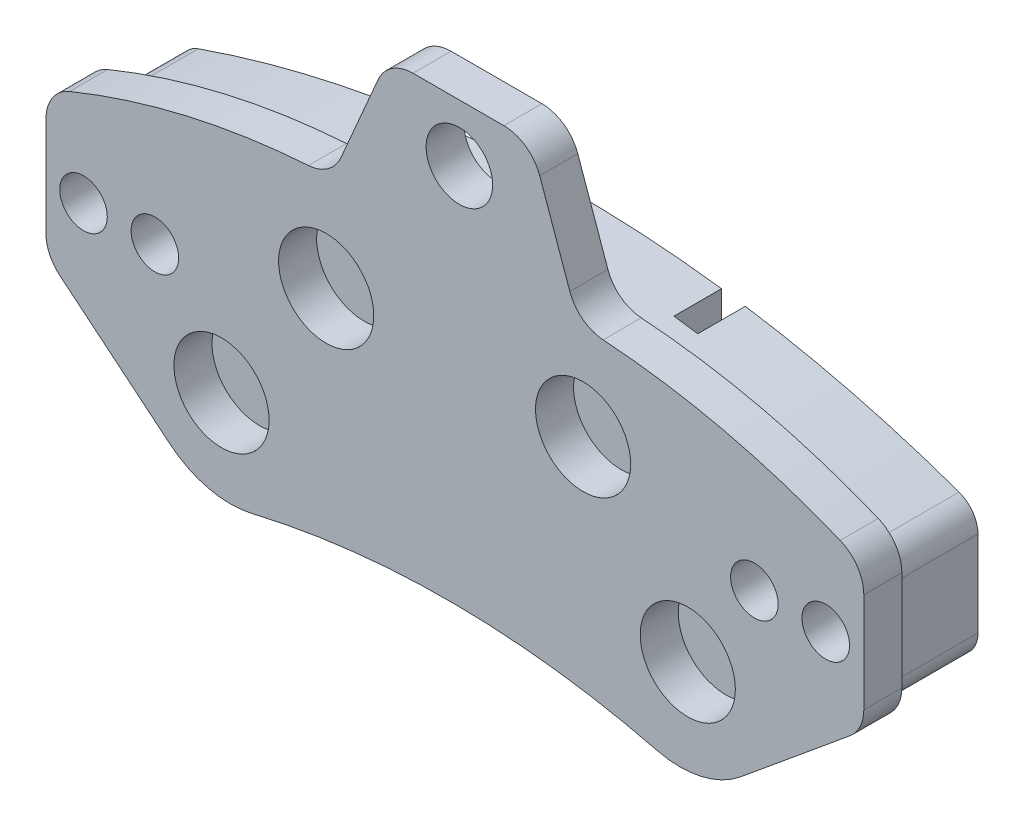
from build123d import *

# Parameters (mm, degrees)
ESQUISSE1_R             = 3.5
ESQUISSE1_R_2           = 2.5
ESQUISSE1_R_3           = 5
EXTRUSION1_DEPTH        = 4
EXTRUSION2_DEPTH        = 9
ENL_V_START             = -5
ENL_V_MAT_EXTRU_1_DEPTH = 5


with BuildPart() as part:
    # Esquisse1 → Extrusion1 (new body)
    with BuildSketch(Plane.XY):
        with BuildLine():
            Line((-4.869143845, 56), (4.671572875, 56))
            ThreePointArc((4.671572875, 56), (6.980973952, 55.265986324), (8.442809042, 53.333333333))
            Line((8.442809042, 53.333333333), (11.6082658, 44.380069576))
            ThreePointArc((11.6082658, 44.380069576), (12.96022052, 42.527955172), (15.107228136, 41.722680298))
            ThreePointArc((15.107228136, 41.722680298), (27.795699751, 39.825876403), (40.017802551, 35.925186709))
            ThreePointArc((40.017802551, 35.925186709), (41.821988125, 34.452430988), (42.5, 32.224338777))
            Line((42.5, 32.224338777), (42.5, 21.743482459))
            ThreePointArc((42.5, 21.743482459), (42.118136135, 20.037876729), (41.045454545, 18.657925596))
            Line((41.045454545, 18.657925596), (29.553799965, 9.177794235))
            ThreePointArc((29.553799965, 9.177794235), (25.394935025, 7.137764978), (20.762972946, 7.190720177))
            ThreePointArc((20.762972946, 7.190720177), (-0.484594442, 9.880043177), (-21.765977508, 7.472905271))
            ThreePointArc((-21.765977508, 7.472905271), (-26.333665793, 7.466147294), (-30.427862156, 9.491333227))
            Line((-30.427862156, 9.491333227), (-41.986580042, 19.026788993))
            ThreePointArc((-41.986580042, 19.026788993), (-43.059261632, 20.406740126), (-43.441125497, 22.112345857))
            Line((-43.441125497, 22.112345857), (-43.441125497, 32.593202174))
            ThreePointArc((-43.441125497, 32.593202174), (-42.763113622, 34.821294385), (-40.958928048, 36.294050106))
            ThreePointArc((-40.958928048, 36.294050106), (-28.64761844, 40.215447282), (-15.865606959, 42.103801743))
            ThreePointArc((-15.865606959, 42.103801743), (-13.821906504, 42.827339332), (-12.455870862, 44.510837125))
            Line((-12.455870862, 44.510837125), (-8.542016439, 53.584300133))
            ThreePointArc((-8.542016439, 53.584300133), (-7.06718837, 55.341945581), (-4.869143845, 56))
        make_face()
        with Locations((0, 50)):
            Circle(ESQUISSE1_R, mode=Mode.SUBTRACT)
        with Locations((38.5, 26.857864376)):
            Circle(ESQUISSE1_R_2, mode=Mode.SUBTRACT)
        with Locations((31, 26.857864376)):
            Circle(ESQUISSE1_R_2, mode=Mode.SUBTRACT)
        with Locations((-32, 26.857864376)):
            Circle(ESQUISSE1_R_2, mode=Mode.SUBTRACT)
        with Locations((-39.5, 26.857864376)):
            Circle(ESQUISSE1_R_2, mode=Mode.SUBTRACT)
        with Locations((-25, 16.857864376)):
            Circle(ESQUISSE1_R_3, mode=Mode.SUBTRACT)
        with Locations((24, 16.857864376)):
            Circle(ESQUISSE1_R_3, mode=Mode.SUBTRACT)
        with Locations((-14, 31.857864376)):
            Circle(ESQUISSE1_R_3, mode=Mode.SUBTRACT)
        with Locations((13, 31.857864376)):
            Circle(ESQUISSE1_R_3, mode=Mode.SUBTRACT)
    extrude(amount=-EXTRUSION1_DEPTH)

    # Esquisse2 → Extrusion2 (add)
    with BuildSketch(Plane(origin=(0, 0, -4), x_dir=(-1, 0, 0), z_dir=(0, 0, -1))):
        with BuildLine():
            Line((42.441125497, 31.112345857), (42.441125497, 22.112345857))
            ThreePointArc((42.441125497, 22.112345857), (42.154727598, 20.833141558), (41.350216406, 19.798178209))
            Line((41.350216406, 19.798178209), (30.30078424, 10.682861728))
            ThreePointArc((30.30078424, 10.682861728), (26.213099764, 8.659195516), (21.651917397, 8.661368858))
            ThreePointArc((21.651917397, 8.661368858), (0.484889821, 11.04090389), (-20.648532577, 8.379381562))
            ThreePointArc((-20.648532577, 8.379381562), (-25.274341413, 8.330920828), (-29.426988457, 10.369542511))
            Line((-29.426988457, 10.369542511), (-40.409090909, 19.429314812))
            ThreePointArc((-40.409090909, 19.429314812), (-41.213602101, 20.464278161), (-41.5, 21.743482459))
            Line((-41.5, 21.743482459), (-41.5, 30.743482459))
            ThreePointArc((-41.5, 30.743482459), (-40.953354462, 32.470054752), (-39.512632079, 33.567411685))
            ThreePointArc((-39.512632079, 33.567411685), (0.424746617, 40.608898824), (40.426983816, 33.945733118))
            ThreePointArc((40.426983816, 33.945733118), (41.886281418, 32.850509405), (42.441125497, 31.112345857))
        make_face()
    extrude(amount=EXTRUSION2_DEPTH)

    # Esquisse3 → Enl_v. mat.-Extru.1 (cut)
    with BuildSketch(Plane(origin=(0, 0, -13), x_dir=(-1, 0, 0), z_dir=(0, 0, -1)).offset(ENL_V_START)):
        with BuildLine():
            Line((15.551917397, 39.723750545), (15.551917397, 9.872536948))
            ThreePointArc((15.551917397, 9.872536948), (16.803481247, 9.659631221), (18.051917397, 9.429092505))
            Line((18.051917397, 9.429092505), (18.051917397, 39.391476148))
            ThreePointArc((18.051917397, 39.391476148), (16.802790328, 39.564181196), (15.551917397, 39.723750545))
        make_face()
        with BuildLine():
            Line((-17.048532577, 9.197204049), (-17.048532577, 39.246306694))
            ThreePointArc((-17.048532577, 39.246306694), (-15.799461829, 39.429537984), (-14.548532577, 39.599618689))
            Line((-14.548532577, 39.599618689), (-14.548532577, 9.674712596))
            ThreePointArc((-14.548532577, 9.674712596), (-15.80022065, 9.444796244), (-17.048532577, 9.197204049))
        make_face()
    extrude(amount=ENL_V_MAT_EXTRU_1_DEPTH, mode=Mode.SUBTRACT)


solid = part.part
